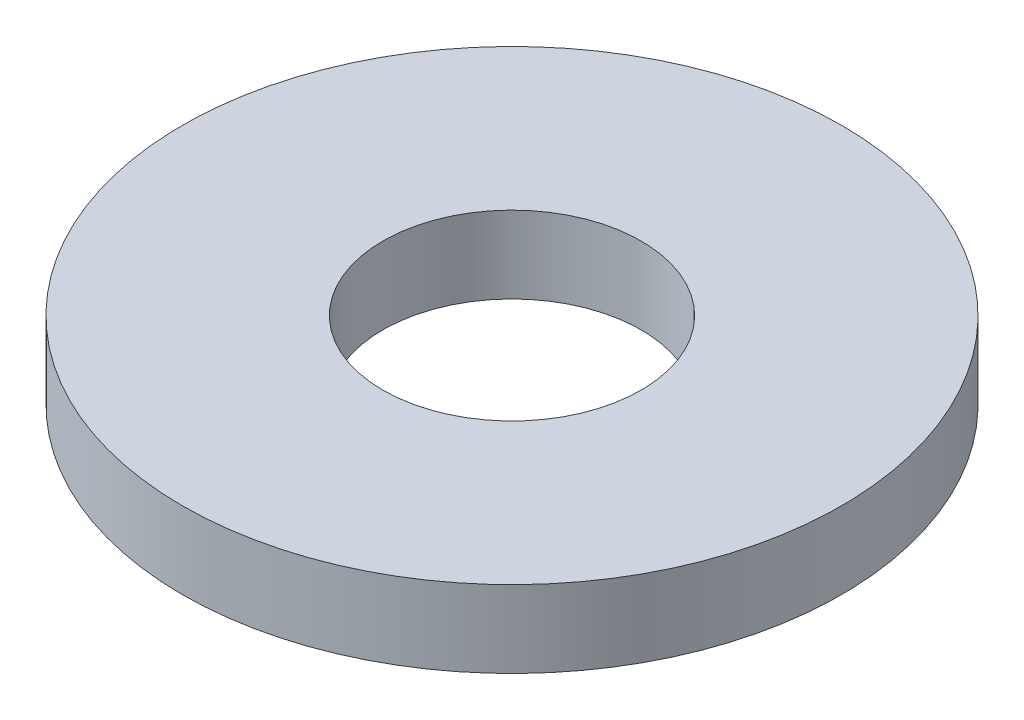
ISO-10303-21;
HEADER;
FILE_DESCRIPTION(('STEP AP214'),'2;1');
FILE_NAME('part.step','',(''),(''),'','','');
FILE_SCHEMA(('AUTOMOTIVE_DESIGN { 1 0 10303 214 1 1 1 1 }'));
ENDSEC;
DATA;
#1=APPLICATION_CONTEXT('core data for automotive mechanical design processes');
#2=APPLICATION_PROTOCOL_DEFINITION('international standard','automotive_design',2000,#1);
#3=PRODUCT_CONTEXT('',#1,'mechanical');
#4=PRODUCT('Part','Part','',(#3));
#5=PRODUCT_RELATED_PRODUCT_CATEGORY('part','',(#4));
#6=PRODUCT_DEFINITION_FORMATION('','',#4);
#7=PRODUCT_DEFINITION_CONTEXT('part definition',#1,'design');
#8=PRODUCT_DEFINITION('design','',#6,#7);
#9=PRODUCT_DEFINITION_SHAPE('','',#8);
#10=(LENGTH_UNIT() NAMED_UNIT(*) SI_UNIT(.MILLI.,.METRE.));
#11=(NAMED_UNIT(*) PLANE_ANGLE_UNIT() SI_UNIT($,.RADIAN.));
#12=(NAMED_UNIT(*) SI_UNIT($,.STERADIAN.) SOLID_ANGLE_UNIT());
#13=UNCERTAINTY_MEASURE_WITH_UNIT(LENGTH_MEASURE(1.E-05),#10,'distance_accuracy_value','');
#14=(GEOMETRIC_REPRESENTATION_CONTEXT(3) GLOBAL_UNCERTAINTY_ASSIGNED_CONTEXT((#13)) GLOBAL_UNIT_ASSIGNED_CONTEXT((#10,
#11,#12)) REPRESENTATION_CONTEXT('',''));
#15=CARTESIAN_POINT('',(0.,0.,0.));
#16=DIRECTION('',(0.,0.,1.));
#17=DIRECTION('',(1.,0.,0.));
#18=AXIS2_PLACEMENT_3D('',#15,#16,#17);
#19=CARTESIAN_POINT('',(0.,1.4,0.));
#20=DIRECTION('',(0.,1.,0.));
#21=DIRECTION('',(0.,0.,1.));
#22=AXIS2_PLACEMENT_3D('',#19,#20,#21);
#23=PLANE('',#22);
#24=CARTESIAN_POINT('',(0.,1.4,0.));
#25=DIRECTION('',(0.,1.,0.));
#26=DIRECTION('',(0.,0.,1.));
#27=AXIS2_PLACEMENT_3D('',#24,#25,#26);
#28=CIRCLE('',#27,5.9944);
#29=CARTESIAN_POINT('',(0.,1.4,5.9944));
#30=VERTEX_POINT('',#29);
#31=EDGE_CURVE('E10',#30,#30,#28,.T.);
#32=ORIENTED_EDGE('',*,*,#31,.T.);
#33=EDGE_LOOP('',(#32));
#34=FACE_BOUND('',#33,.T.);
#35=CARTESIAN_POINT('',(0.,1.4,0.));
#36=DIRECTION('',(0.,1.,0.));
#37=DIRECTION('',(0.,0.,1.));
#38=AXIS2_PLACEMENT_3D('',#35,#36,#37);
#39=CIRCLE('',#38,2.3495);
#40=CARTESIAN_POINT('',(0.,1.4,2.3495));
#41=VERTEX_POINT('',#40);
#42=EDGE_CURVE('E44',#41,#41,#39,.T.);
#43=ORIENTED_EDGE('',*,*,#42,.F.);
#44=EDGE_LOOP('',(#43));
#45=FACE_BOUND('',#44,.T.);
#46=ADVANCED_FACE('F33',(#34,#45),#23,.T.);
#47=CARTESIAN_POINT('',(0.,0.,0.));
#48=DIRECTION('',(0.,1.,0.));
#49=DIRECTION('',(0.,0.,1.));
#50=AXIS2_PLACEMENT_3D('',#47,#48,#49);
#51=PLANE('',#50);
#52=CARTESIAN_POINT('',(0.,0.,0.));
#53=DIRECTION('',(0.,1.,0.));
#54=DIRECTION('',(0.,0.,1.));
#55=AXIS2_PLACEMENT_3D('',#52,#53,#54);
#56=CIRCLE('',#55,5.9944);
#57=CARTESIAN_POINT('',(0.,0.,5.9944));
#58=VERTEX_POINT('',#57);
#59=EDGE_CURVE('E37',#58,#58,#56,.T.);
#60=ORIENTED_EDGE('',*,*,#59,.F.);
#61=EDGE_LOOP('',(#60));
#62=FACE_BOUND('',#61,.T.);
#63=CARTESIAN_POINT('',(0.,0.,0.));
#64=DIRECTION('',(0.,1.,0.));
#65=DIRECTION('',(0.,0.,1.));
#66=AXIS2_PLACEMENT_3D('',#63,#64,#65);
#67=CIRCLE('',#66,2.3495);
#68=CARTESIAN_POINT('',(0.,0.,2.3495));
#69=VERTEX_POINT('',#68);
#70=EDGE_CURVE('E46',#69,#69,#67,.T.);
#71=ORIENTED_EDGE('',*,*,#70,.T.);
#72=EDGE_LOOP('',(#71));
#73=FACE_BOUND('',#72,.T.);
#74=ADVANCED_FACE('F56',(#62,#73),#51,.F.);
#75=CARTESIAN_POINT('',(0.,1.4,0.));
#76=DIRECTION('',(0.,-1.,0.));
#77=DIRECTION('',(0.,0.,-1.));
#78=AXIS2_PLACEMENT_3D('',#75,#76,#77);
#79=CYLINDRICAL_SURFACE('',#78,5.9944);
#80=ORIENTED_EDGE('',*,*,#31,.F.);
#81=EDGE_LOOP('',(#80));
#82=FACE_BOUND('',#81,.T.);
#83=ORIENTED_EDGE('',*,*,#59,.T.);
#84=EDGE_LOOP('',(#83));
#85=FACE_BOUND('',#84,.T.);
#86=ADVANCED_FACE('F35',(#82,#85),#79,.T.);
#87=CARTESIAN_POINT('',(0.,1.4,0.));
#88=DIRECTION('',(0.,-1.,0.));
#89=DIRECTION('',(0.,0.,-1.));
#90=AXIS2_PLACEMENT_3D('',#87,#88,#89);
#91=CYLINDRICAL_SURFACE('',#90,2.3495);
#92=ORIENTED_EDGE('',*,*,#42,.T.);
#93=EDGE_LOOP('',(#92));
#94=FACE_BOUND('',#93,.T.);
#95=ORIENTED_EDGE('',*,*,#70,.F.);
#96=EDGE_LOOP('',(#95));
#97=FACE_BOUND('',#96,.T.);
#98=ADVANCED_FACE('F52',(#94,#97),#91,.F.);
#99=CLOSED_SHELL('',(#46,#74,#86,#98));
#100=MANIFOLD_SOLID_BREP('B2',#99);
#101=ADVANCED_BREP_SHAPE_REPRESENTATION('',(#18,#100),#14);
#102=SHAPE_DEFINITION_REPRESENTATION(#9,#101);
ENDSEC;
END-ISO-10303-21;
